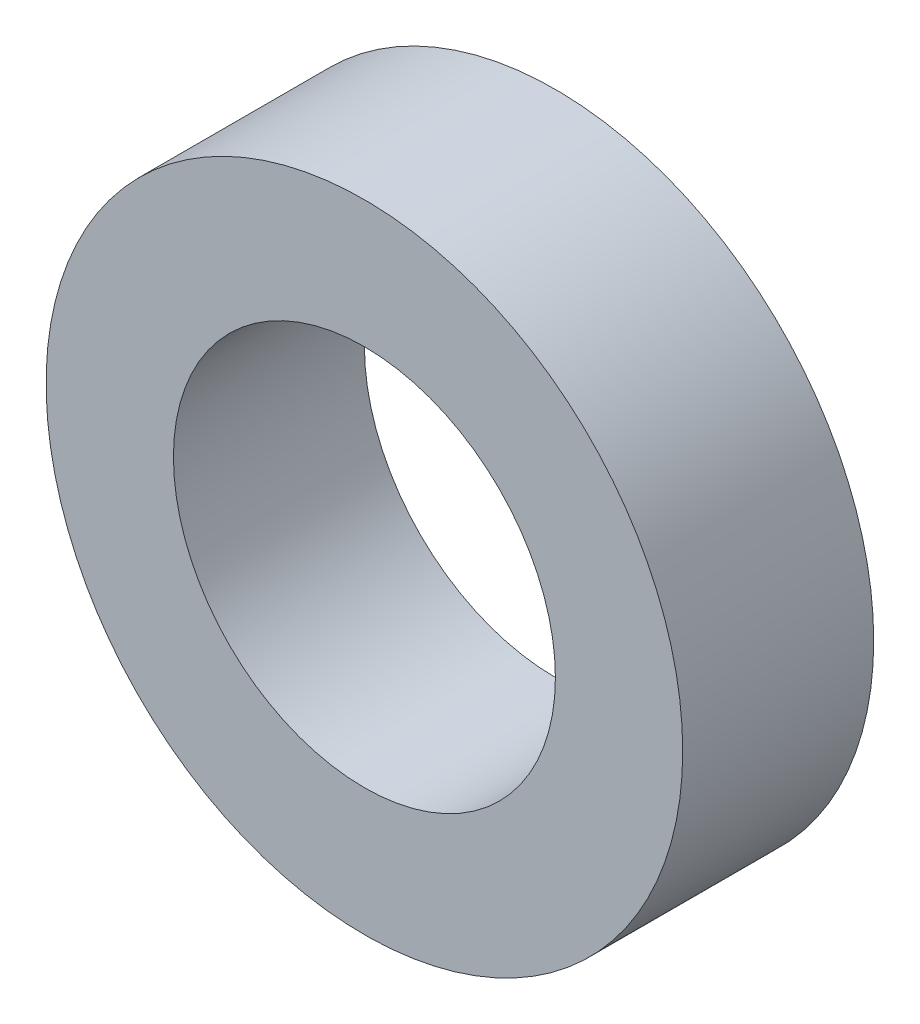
from build123d import *

# Parameters (mm, degrees)
ESQUISSE1_R        = 2.5
ESQUISSE1_R_2      = 1.5
BOSS_EXTRU_1_DEPTH = 1.5


with BuildPart() as part:
    # Esquisse1 → Boss.-Extru.1 (new body)
    with BuildSketch(Plane.XY):
        Circle(ESQUISSE1_R)
        Circle(ESQUISSE1_R_2, mode=Mode.SUBTRACT)
    extrude(amount=BOSS_EXTRU_1_DEPTH)


solid = part.part
